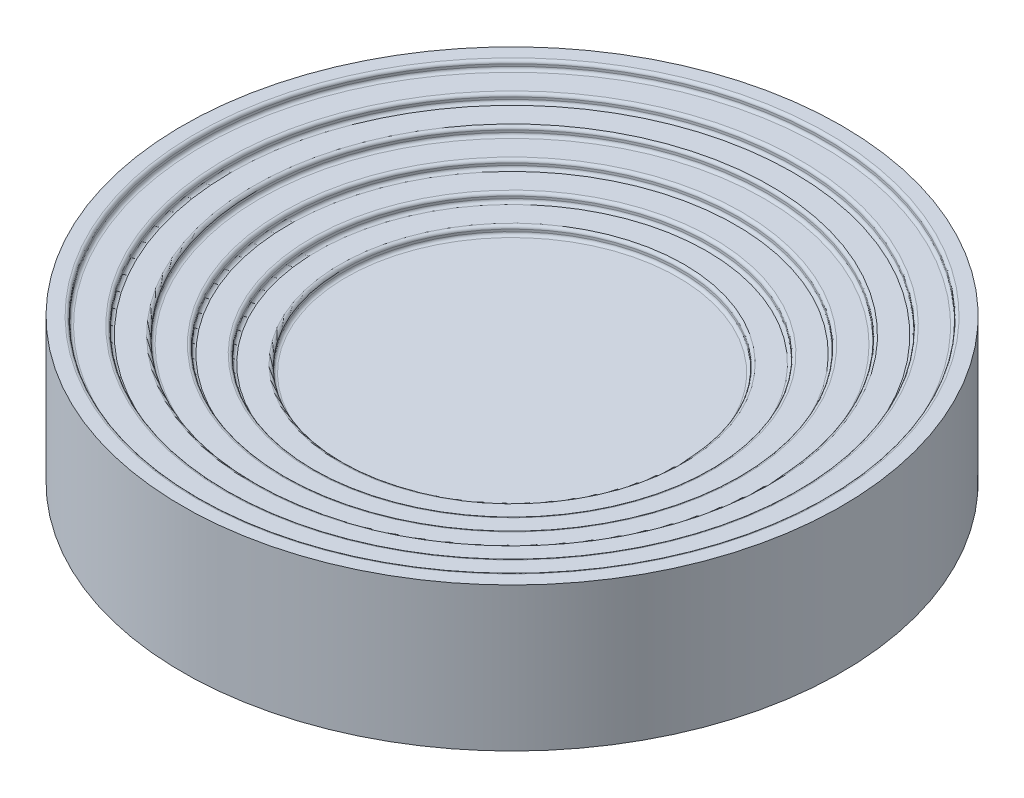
from build123d import *

# Parameters (mm, degrees)
ZAOKR_GLENIE1_R            = 1
SZKIC3_R                   = 102
WYTNIJ_WYCI_GNI_CIE1_DEPTH = 27


with BuildPart() as part:
    # Szkic2 → Obr_t1 (revolve)
    with BuildSketch(Plane.XY, mode=Mode.PRIVATE) as obr_t1_sk:
        Polygon((0, 0), (110, 0), (110, 48), (104.5, 48), (104.5, 45.25), (94.875, 45.25), (94.875, 42.5), (85.25, 42.5), (85.25, 39.75), (75.625, 39.75), (75.625, 37), (66, 37), (66, 34.25), (56.375, 34.25), (56.375, 31.5), (0, 31.5), align=None)
    revolve(obr_t1_sk.sketch.rotate(Axis((0, 0, 0), (0, 1, 0)), 90), axis=Axis((0, 0, 0), (0, 1, 0)))

    # Zaokr_glenie1
    zaokr_glenie1_edges = [part.edges().sort_by_distance(p)[0] for p in [
        (0, 48, 104.5),
        (0, 45.25, 104.5),
        (0, 45.25, 94.875),
        (0, 42.5, 94.875),
        (0, 42.5, 85.25),
        (0, 39.75, 85.25),
        (0, 39.75, 75.625),
        (0, 37, 75.625),
        (0, 37, 66),
        (0, 34.25, 66),
        (0, 34.25, 56.375),
        (0, 31.5, 56.375),
    ]]
    fillet(zaokr_glenie1_edges, radius=ZAOKR_GLENIE1_R)

    # Szkic3 → Wytnij-wyci_gni_cie1 (cut)
    with BuildSketch(Plane.XZ):
        with Locations(Location((0, 0, 0), (0, 0, 270))):
            Circle(SZKIC3_R)
    extrude(amount=-WYTNIJ_WYCI_GNI_CIE1_DEPTH, mode=Mode.SUBTRACT)


solid = part.part
